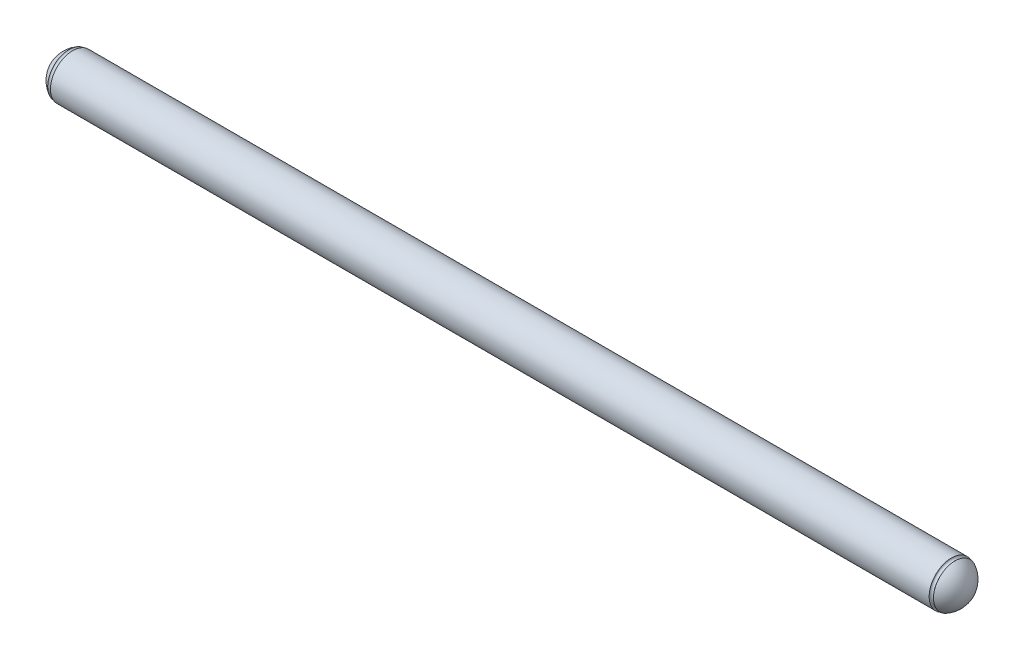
ISO-10303-21;
HEADER;
FILE_DESCRIPTION(('STEP AP214'),'2;1');
FILE_NAME('part.step','',(''),(''),'','','');
FILE_SCHEMA(('AUTOMOTIVE_DESIGN { 1 0 10303 214 1 1 1 1 }'));
ENDSEC;
DATA;
#1=APPLICATION_CONTEXT('core data for automotive mechanical design processes');
#2=APPLICATION_PROTOCOL_DEFINITION('international standard','automotive_design',2000,#1);
#3=PRODUCT_CONTEXT('',#1,'mechanical');
#4=PRODUCT('Part','Part','',(#3));
#5=PRODUCT_RELATED_PRODUCT_CATEGORY('part','',(#4));
#6=PRODUCT_DEFINITION_FORMATION('','',#4);
#7=PRODUCT_DEFINITION_CONTEXT('part definition',#1,'design');
#8=PRODUCT_DEFINITION('design','',#6,#7);
#9=PRODUCT_DEFINITION_SHAPE('','',#8);
#10=(LENGTH_UNIT() NAMED_UNIT(*) SI_UNIT(.MILLI.,.METRE.));
#11=(NAMED_UNIT(*) PLANE_ANGLE_UNIT() SI_UNIT($,.RADIAN.));
#12=(NAMED_UNIT(*) SI_UNIT($,.STERADIAN.) SOLID_ANGLE_UNIT());
#13=UNCERTAINTY_MEASURE_WITH_UNIT(LENGTH_MEASURE(1.E-05),#10,'distance_accuracy_value','');
#14=(GEOMETRIC_REPRESENTATION_CONTEXT(3) GLOBAL_UNCERTAINTY_ASSIGNED_CONTEXT((#13)) GLOBAL_UNIT_ASSIGNED_CONTEXT((#10,
#11,#12)) REPRESENTATION_CONTEXT('',''));
#15=CARTESIAN_POINT('',(0.,0.,0.));
#16=DIRECTION('',(0.,0.,1.));
#17=DIRECTION('',(1.,0.,0.));
#18=AXIS2_PLACEMENT_3D('',#15,#16,#17);
#19=CARTESIAN_POINT('',(-58.25,0.,0.));
#20=DIRECTION('',(-1.,0.,0.));
#21=DIRECTION('',(0.,1.,0.));
#22=AXIS2_PLACEMENT_3D('',#19,#20,#21);
#23=SPHERICAL_SURFACE('',#22,3.25);
#24=CARTESIAN_POINT('',(-59.7269002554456,0.,0.));
#25=DIRECTION('',(-1.,0.,0.));
#26=DIRECTION('',(0.,0.,1.));
#27=AXIS2_PLACEMENT_3D('',#24,#25,#26);
#28=CIRCLE('',#27,2.89504156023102);
#29=CARTESIAN_POINT('',(-59.7269002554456,0.,2.89504156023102));
#30=VERTEX_POINT('',#29);
#31=EDGE_CURVE('E43',#30,#30,#28,.T.);
#32=ORIENTED_EDGE('',*,*,#31,.T.);
#33=EDGE_LOOP('',(#32));
#34=FACE_BOUND('',#33,.T.);
#35=ADVANCED_FACE('F29',(#34),#23,.T.);
#36=CARTESIAN_POINT('',(58.25,0.,0.));
#37=DIRECTION('',(-1.,0.,0.));
#38=DIRECTION('',(0.,1.,0.));
#39=AXIS2_PLACEMENT_3D('',#36,#37,#38);
#40=SPHERICAL_SURFACE('',#39,3.25);
#41=CARTESIAN_POINT('',(59.7269002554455,0.,0.));
#42=DIRECTION('',(-1.,0.,0.));
#43=DIRECTION('',(0.,0.,1.));
#44=AXIS2_PLACEMENT_3D('',#41,#42,#43);
#45=CIRCLE('',#44,2.89504156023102);
#46=CARTESIAN_POINT('',(59.7269002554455,0.,2.89504156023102));
#47=VERTEX_POINT('',#46);
#48=EDGE_CURVE('E10',#47,#47,#45,.T.);
#49=ORIENTED_EDGE('',*,*,#48,.F.);
#50=EDGE_LOOP('',(#49));
#51=FACE_BOUND('',#50,.T.);
#52=ADVANCED_FACE('F63',(#51),#40,.T.);
#53=CARTESIAN_POINT('',(59.5,0.,0.));
#54=DIRECTION('',(-1.,0.,0.));
#55=DIRECTION('',(0.,0.,1.));
#56=AXIS2_PLACEMENT_3D('',#53,#54,#55);
#57=TOROIDAL_SURFACE('',#56,3.,0.250000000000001);
#58=CARTESIAN_POINT('',(59.25,0.,0.));
#59=DIRECTION('',(-1.,0.,0.));
#60=DIRECTION('',(0.,0.,1.));
#61=AXIS2_PLACEMENT_3D('',#58,#59,#60);
#62=CIRCLE('',#61,3.);
#63=CARTESIAN_POINT('',(59.25,0.,3.));
#64=VERTEX_POINT('',#63);
#65=EDGE_CURVE('E35',#64,#64,#62,.T.);
#66=ORIENTED_EDGE('',*,*,#65,.F.);
#67=EDGE_LOOP('',(#66));
#68=FACE_BOUND('',#67,.T.);
#69=ORIENTED_EDGE('',*,*,#48,.T.);
#70=EDGE_LOOP('',(#69));
#71=FACE_BOUND('',#70,.T.);
#72=ADVANCED_FACE('F58',(#68,#71),#57,.F.);
#73=CARTESIAN_POINT('',(-61.5,0.,0.));
#74=DIRECTION('',(-1.,0.,0.));
#75=DIRECTION('',(0.,0.,1.));
#76=AXIS2_PLACEMENT_3D('',#73,#74,#75);
#77=CYLINDRICAL_SURFACE('',#76,3.);
#78=CARTESIAN_POINT('',(-59.25,0.,0.));
#79=DIRECTION('',(-1.,0.,0.));
#80=DIRECTION('',(0.,0.,1.));
#81=AXIS2_PLACEMENT_3D('',#78,#79,#80);
#82=CIRCLE('',#81,3.);
#83=CARTESIAN_POINT('',(-59.25,0.,3.));
#84=VERTEX_POINT('',#83);
#85=EDGE_CURVE('E39',#84,#84,#82,.T.);
#86=ORIENTED_EDGE('',*,*,#85,.F.);
#87=EDGE_LOOP('',(#86));
#88=FACE_BOUND('',#87,.T.);
#89=ORIENTED_EDGE('',*,*,#65,.T.);
#90=EDGE_LOOP('',(#89));
#91=FACE_BOUND('',#90,.T.);
#92=ADVANCED_FACE('F53',(#88,#91),#77,.T.);
#93=CARTESIAN_POINT('',(-59.5,0.,0.));
#94=DIRECTION('',(-1.,0.,0.));
#95=DIRECTION('',(0.,0.,1.));
#96=AXIS2_PLACEMENT_3D('',#93,#94,#95);
#97=TOROIDAL_SURFACE('',#96,3.,0.250000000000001);
#98=ORIENTED_EDGE('',*,*,#31,.F.);
#99=EDGE_LOOP('',(#98));
#100=FACE_BOUND('',#99,.T.);
#101=ORIENTED_EDGE('',*,*,#85,.T.);
#102=EDGE_LOOP('',(#101));
#103=FACE_BOUND('',#102,.T.);
#104=ADVANCED_FACE('F50',(#100,#103),#97,.F.);
#105=CLOSED_SHELL('',(#35,#52,#72,#92,#104));
#106=MANIFOLD_SOLID_BREP('B2',#105);
#107=ADVANCED_BREP_SHAPE_REPRESENTATION('',(#18,#106),#14);
#108=SHAPE_DEFINITION_REPRESENTATION(#9,#107);
ENDSEC;
END-ISO-10303-21;
